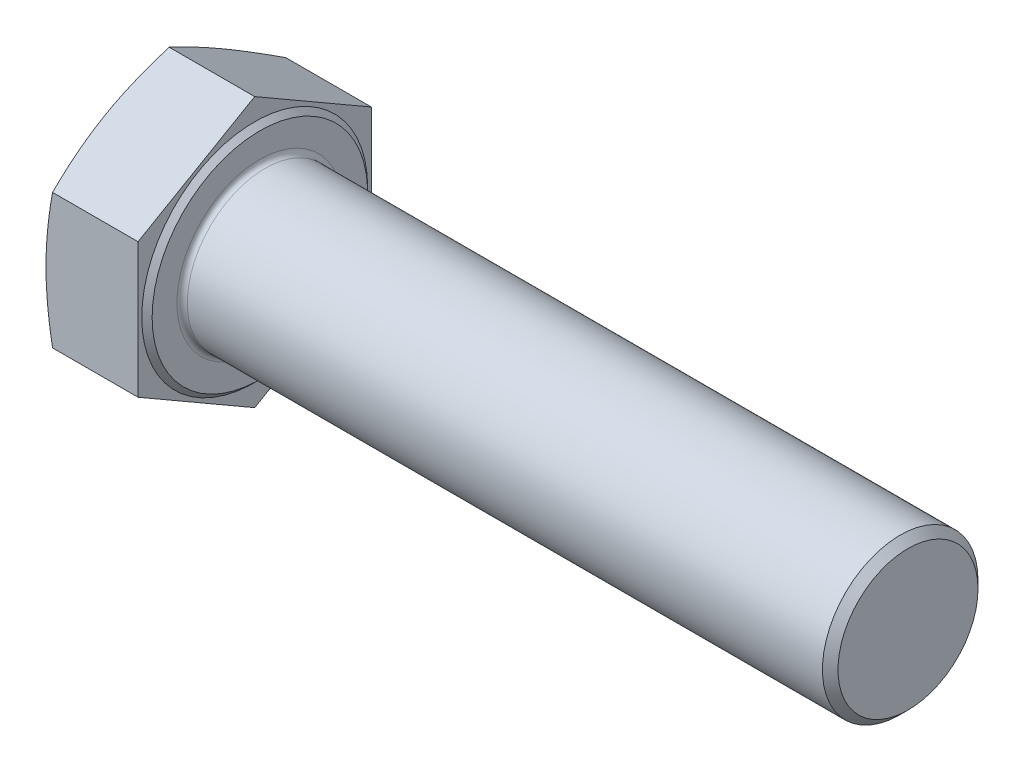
from build123d import *

# Parameters (mm, degrees)
BASEHEAD_DEPTH = 15
SKETCH5_R      = 12
BASEBODY_DEPTH = 100
CHAMFER1_SIZE  = 1.2
HEADFILLET_R   = 0.8


with BuildPart() as part:
    # Sketch2 → BaseHead (new body)
    with BuildSketch(Plane(origin=(0, 0, 0), x_dir=(0, 0, -1), z_dir=(1, 0, 0))):
        Polygon((0, -20.784609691), (18, -10.392304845), (18, 10.392304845), (0, 20.784609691), (-18, 10.392304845), (-18, -10.392304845), align=None)
    extrude(amount=BASEHEAD_DEPTH)

    # Sketch3 → BearingFace (revolve, cut)
    with BuildSketch(Plane.XY, mode=Mode.PRIVATE) as bearingface_sk:
        Polygon((15, 20.784609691), (15, 16.625), (14.2, 17.425), (14.2, 20.784609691), align=None)
    revolve(bearingface_sk.sketch.rotate(Axis((-0.957090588, 0, 0), (1, 0, 0)), 90), axis=Axis((-0.957090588, 0, 0), (1, 0, 0)), mode=Mode.SUBTRACT)

    # Sketch4 → HeadChamfer (revolve, cut)
    with BuildSketch(Plane.XY):
        Polygon((0, 20.784609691), (1.013515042, 20.784609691), (0, 18), align=None)
    revolve(axis=Axis((-0.493528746, 0, 0), (1, 0, 0)), mode=Mode.SUBTRACT)

    # Sketch5 → BaseBody (add)
    with BuildSketch(Plane(origin=(15, 0, 0), x_dir=(0, 0, -1), z_dir=(1, 0, 0))):
        Circle(SKETCH5_R)
    extrude(amount=BASEBODY_DEPTH)

    # Chamfer1
    chamfer1_edges = [part.edges().sort_by_distance(p)[0] for p in [
        (115, 0, 12),
    ]]
    chamfer(chamfer1_edges, length=CHAMFER1_SIZE)

    # HeadFillet
    headfillet_edges = [part.edges().sort_by_distance(p)[0] for p in [
        (15, 0, 12),
    ]]
    fillet(headfillet_edges, radius=HEADFILLET_R)


solid = part.part
